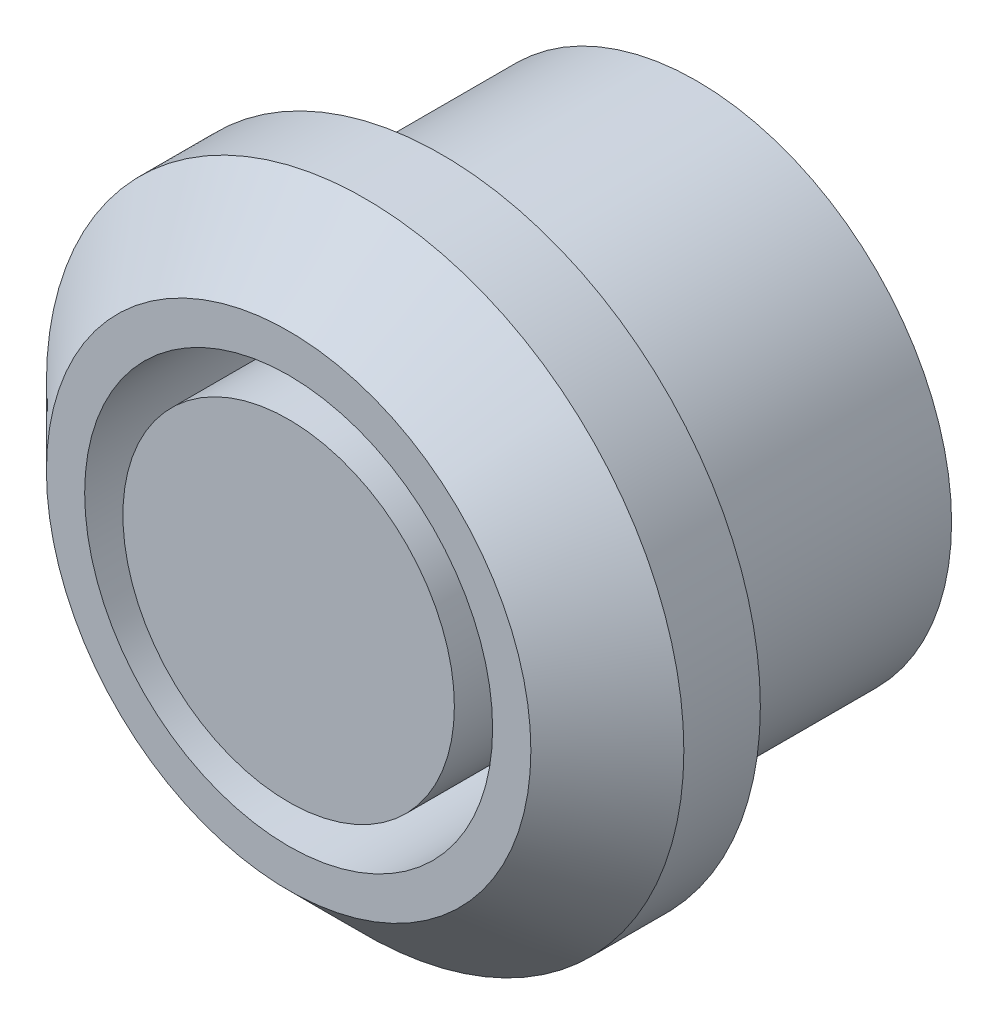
ISO-10303-21;
HEADER;
FILE_DESCRIPTION(('STEP AP214'),'2;1');
FILE_NAME('part.step','',(''),(''),'','','');
FILE_SCHEMA(('AUTOMOTIVE_DESIGN { 1 0 10303 214 1 1 1 1 }'));
ENDSEC;
DATA;
#1=APPLICATION_CONTEXT('core data for automotive mechanical design processes');
#2=APPLICATION_PROTOCOL_DEFINITION('international standard','automotive_design',2000,#1);
#3=PRODUCT_CONTEXT('',#1,'mechanical');
#4=PRODUCT('Part','Part','',(#3));
#5=PRODUCT_RELATED_PRODUCT_CATEGORY('part','',(#4));
#6=PRODUCT_DEFINITION_FORMATION('','',#4);
#7=PRODUCT_DEFINITION_CONTEXT('part definition',#1,'design');
#8=PRODUCT_DEFINITION('design','',#6,#7);
#9=PRODUCT_DEFINITION_SHAPE('','',#8);
#10=(LENGTH_UNIT() NAMED_UNIT(*) SI_UNIT(.MILLI.,.METRE.));
#11=(NAMED_UNIT(*) PLANE_ANGLE_UNIT() SI_UNIT($,.RADIAN.));
#12=(NAMED_UNIT(*) SI_UNIT($,.STERADIAN.) SOLID_ANGLE_UNIT());
#13=UNCERTAINTY_MEASURE_WITH_UNIT(LENGTH_MEASURE(1.E-05),#10,'distance_accuracy_value','');
#14=(GEOMETRIC_REPRESENTATION_CONTEXT(3) GLOBAL_UNCERTAINTY_ASSIGNED_CONTEXT((#13)) GLOBAL_UNIT_ASSIGNED_CONTEXT((#10,
#11,#12)) REPRESENTATION_CONTEXT('',''));
#15=CARTESIAN_POINT('',(0.,0.,0.));
#16=DIRECTION('',(0.,0.,1.));
#17=DIRECTION('',(1.,0.,0.));
#18=AXIS2_PLACEMENT_3D('',#15,#16,#17);
#19=CARTESIAN_POINT('',(0.,0.,-4.));
#20=DIRECTION('',(0.,0.,1.));
#21=DIRECTION('',(1.,0.,0.));
#22=AXIS2_PLACEMENT_3D('',#19,#20,#21);
#23=PLANE('',#22);
#24=CARTESIAN_POINT('',(0.,0.,-4.));
#25=DIRECTION('',(0.,0.,1.));
#26=DIRECTION('',(1.,0.,0.));
#27=AXIS2_PLACEMENT_3D('',#24,#25,#26);
#28=CIRCLE('',#27,8.);
#29=CARTESIAN_POINT('',(8.,0.,-4.));
#30=VERTEX_POINT('',#29);
#31=EDGE_CURVE('E45',#30,#30,#28,.T.);
#32=ORIENTED_EDGE('',*,*,#31,.T.);
#33=EDGE_LOOP('',(#32));
#34=FACE_BOUND('',#33,.T.);
#35=CARTESIAN_POINT('',(0.,0.,-4.));
#36=DIRECTION('',(0.,0.,1.));
#37=DIRECTION('',(1.,0.,0.));
#38=AXIS2_PLACEMENT_3D('',#35,#36,#37);
#39=CIRCLE('',#38,6.5);
#40=CARTESIAN_POINT('',(6.5,0.,-4.));
#41=VERTEX_POINT('',#40);
#42=EDGE_CURVE('E54',#41,#41,#39,.T.);
#43=ORIENTED_EDGE('',*,*,#42,.F.);
#44=EDGE_LOOP('',(#43));
#45=FACE_BOUND('',#44,.T.);
#46=ADVANCED_FACE('F22',(#34,#45),#23,.T.);
#47=CARTESIAN_POINT('',(0.,0.,0.));
#48=DIRECTION('',(0.,0.,1.));
#49=DIRECTION('',(1.,0.,0.));
#50=AXIS2_PLACEMENT_3D('',#47,#48,#49);
#51=PLANE('',#50);
#52=CARTESIAN_POINT('',(0.,0.,0.));
#53=DIRECTION('',(0.,0.,1.));
#54=DIRECTION('',(1.,0.,0.));
#55=AXIS2_PLACEMENT_3D('',#52,#53,#54);
#56=CIRCLE('',#55,12.5);
#57=CARTESIAN_POINT('',(12.5,0.,0.));
#58=VERTEX_POINT('',#57);
#59=EDGE_CURVE('E37',#58,#58,#56,.T.);
#60=ORIENTED_EDGE('',*,*,#59,.F.);
#61=EDGE_LOOP('',(#60));
#62=FACE_BOUND('',#61,.T.);
#63=CARTESIAN_POINT('',(0.,0.,0.));
#64=DIRECTION('',(0.,0.,1.));
#65=DIRECTION('',(1.,0.,0.));
#66=AXIS2_PLACEMENT_3D('',#63,#64,#65);
#67=CIRCLE('',#66,10.);
#68=CARTESIAN_POINT('',(10.,0.,0.));
#69=VERTEX_POINT('',#68);
#70=EDGE_CURVE('E10',#69,#69,#67,.F.);
#71=ORIENTED_EDGE('',*,*,#70,.F.);
#72=EDGE_LOOP('',(#71));
#73=FACE_BOUND('',#72,.T.);
#74=ADVANCED_FACE('F61',(#62,#73),#51,.F.);
#75=CARTESIAN_POINT('',(0.,0.,6.));
#76=DIRECTION('',(0.,0.,-1.));
#77=DIRECTION('',(-1.,0.,0.));
#78=AXIS2_PLACEMENT_3D('',#75,#76,#77);
#79=CYLINDRICAL_SURFACE('',#78,12.5);
#80=CARTESIAN_POINT('',(0.,0.,2.99999999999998));
#81=DIRECTION('',(0.,0.,1.));
#82=DIRECTION('',(1.,0.,0.));
#83=AXIS2_PLACEMENT_3D('',#80,#81,#82);
#84=CIRCLE('',#83,12.5);
#85=CARTESIAN_POINT('',(12.5,0.,2.99999999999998));
#86=VERTEX_POINT('',#85);
#87=EDGE_CURVE('E29',#86,#86,#84,.F.);
#88=ORIENTED_EDGE('',*,*,#87,.T.);
#89=EDGE_LOOP('',(#88));
#90=FACE_BOUND('',#89,.T.);
#91=ORIENTED_EDGE('',*,*,#59,.T.);
#92=EDGE_LOOP('',(#91));
#93=FACE_BOUND('',#92,.T.);
#94=ADVANCED_FACE('F24',(#90,#93),#79,.T.);
#95=CARTESIAN_POINT('',(0.,0.,6.));
#96=DIRECTION('',(0.,0.,1.));
#97=DIRECTION('',(1.,0.,0.));
#98=AXIS2_PLACEMENT_3D('',#95,#96,#97);
#99=PLANE('',#98);
#100=CARTESIAN_POINT('',(0.,0.,6.));
#101=DIRECTION('',(0.,0.,1.));
#102=DIRECTION('',(1.,0.,0.));
#103=AXIS2_PLACEMENT_3D('',#100,#101,#102);
#104=CIRCLE('',#103,8.);
#105=CARTESIAN_POINT('',(8.,0.,6.));
#106=VERTEX_POINT('',#105);
#107=EDGE_CURVE('E48',#106,#106,#104,.T.);
#108=ORIENTED_EDGE('',*,*,#107,.F.);
#109=EDGE_LOOP('',(#108));
#110=FACE_BOUND('',#109,.T.);
#111=CARTESIAN_POINT('',(0.,0.,6.));
#112=DIRECTION('',(0.,0.,1.));
#113=DIRECTION('',(1.,0.,0.));
#114=AXIS2_PLACEMENT_3D('',#111,#112,#113);
#115=CIRCLE('',#114,9.49999999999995);
#116=CARTESIAN_POINT('',(9.49999999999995,0.,6.));
#117=VERTEX_POINT('',#116);
#118=EDGE_CURVE('E33',#117,#117,#115,.T.);
#119=ORIENTED_EDGE('',*,*,#118,.T.);
#120=EDGE_LOOP('',(#119));
#121=FACE_BOUND('',#120,.T.);
#122=ADVANCED_FACE('F86',(#110,#121),#99,.T.);
#123=CARTESIAN_POINT('',(0.,0.,6.));
#124=DIRECTION('',(0.,0.,-1.));
#125=DIRECTION('',(-1.,0.,0.));
#126=AXIS2_PLACEMENT_3D('',#123,#124,#125);
#127=CONICAL_SURFACE('',#126,9.49999999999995,0.785398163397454);
#128=ORIENTED_EDGE('',*,*,#87,.F.);
#129=EDGE_LOOP('',(#128));
#130=FACE_BOUND('',#129,.T.);
#131=ORIENTED_EDGE('',*,*,#118,.F.);
#132=EDGE_LOOP('',(#131));
#133=FACE_BOUND('',#132,.T.);
#134=ADVANCED_FACE('F83',(#130,#133),#127,.T.);
#135=CARTESIAN_POINT('',(0.,0.,-10.));
#136=DIRECTION('',(0.,0.,1.));
#137=DIRECTION('',(1.,0.,0.));
#138=AXIS2_PLACEMENT_3D('',#135,#136,#137);
#139=CYLINDRICAL_SURFACE('',#138,10.);
#140=CARTESIAN_POINT('',(0.,0.,-10.));
#141=DIRECTION('',(0.,0.,-1.));
#142=DIRECTION('',(-1.,0.,0.));
#143=AXIS2_PLACEMENT_3D('',#140,#141,#142);
#144=CIRCLE('',#143,10.);
#145=CARTESIAN_POINT('',(-10.,0.,-10.));
#146=VERTEX_POINT('',#145);
#147=EDGE_CURVE('E42',#146,#146,#144,.T.);
#148=ORIENTED_EDGE('',*,*,#147,.F.);
#149=EDGE_LOOP('',(#148));
#150=FACE_BOUND('',#149,.T.);
#151=ORIENTED_EDGE('',*,*,#70,.T.);
#152=EDGE_LOOP('',(#151));
#153=FACE_BOUND('',#152,.T.);
#154=ADVANCED_FACE('F79',(#150,#153),#139,.T.);
#155=CARTESIAN_POINT('',(0.,0.,-10.));
#156=DIRECTION('',(0.,0.,-1.));
#157=DIRECTION('',(-1.,0.,0.));
#158=AXIS2_PLACEMENT_3D('',#155,#156,#157);
#159=PLANE('',#158);
#160=ORIENTED_EDGE('',*,*,#147,.T.);
#161=EDGE_LOOP('',(#160));
#162=FACE_BOUND('',#161,.T.);
#163=ADVANCED_FACE('F75',(#162),#159,.T.);
#164=CARTESIAN_POINT('',(0.,0.,-4.));
#165=DIRECTION('',(0.,0.,1.));
#166=DIRECTION('',(1.,0.,0.));
#167=AXIS2_PLACEMENT_3D('',#164,#165,#166);
#168=CYLINDRICAL_SURFACE('',#167,8.);
#169=ORIENTED_EDGE('',*,*,#31,.F.);
#170=EDGE_LOOP('',(#169));
#171=FACE_BOUND('',#170,.T.);
#172=ORIENTED_EDGE('',*,*,#107,.T.);
#173=EDGE_LOOP('',(#172));
#174=FACE_BOUND('',#173,.T.);
#175=ADVANCED_FACE('F72',(#171,#174),#168,.F.);
#176=CARTESIAN_POINT('',(0.,0.,6.));
#177=DIRECTION('',(0.,0.,-1.));
#178=DIRECTION('',(-1.,0.,0.));
#179=AXIS2_PLACEMENT_3D('',#176,#177,#178);
#180=CYLINDRICAL_SURFACE('',#179,6.5);
#181=CARTESIAN_POINT('',(0.,0.,6.));
#182=DIRECTION('',(0.,0.,1.));
#183=DIRECTION('',(1.,0.,0.));
#184=AXIS2_PLACEMENT_3D('',#181,#182,#183);
#185=CIRCLE('',#184,6.5);
#186=CARTESIAN_POINT('',(6.5,0.,6.));
#187=VERTEX_POINT('',#186);
#188=EDGE_CURVE('E51',#187,#187,#185,.T.);
#189=ORIENTED_EDGE('',*,*,#188,.F.);
#190=EDGE_LOOP('',(#189));
#191=FACE_BOUND('',#190,.T.);
#192=ORIENTED_EDGE('',*,*,#42,.T.);
#193=EDGE_LOOP('',(#192));
#194=FACE_BOUND('',#193,.T.);
#195=ADVANCED_FACE('F58',(#191,#194),#180,.T.);
#196=CARTESIAN_POINT('',(0.,0.,6.));
#197=DIRECTION('',(0.,0.,1.));
#198=DIRECTION('',(1.,0.,0.));
#199=AXIS2_PLACEMENT_3D('',#196,#197,#198);
#200=PLANE('',#199);
#201=ORIENTED_EDGE('',*,*,#188,.T.);
#202=EDGE_LOOP('',(#201));
#203=FACE_BOUND('',#202,.T.);
#204=ADVANCED_FACE('F131',(#203),#200,.T.);
#205=CLOSED_SHELL('',(#46,#74,#94,#122,#134,#154,#163,#175,#195,#204));
#206=MANIFOLD_SOLID_BREP('B2',#205);
#207=ADVANCED_BREP_SHAPE_REPRESENTATION('',(#18,#206),#14);
#208=SHAPE_DEFINITION_REPRESENTATION(#9,#207);
ENDSEC;
END-ISO-10303-21;
